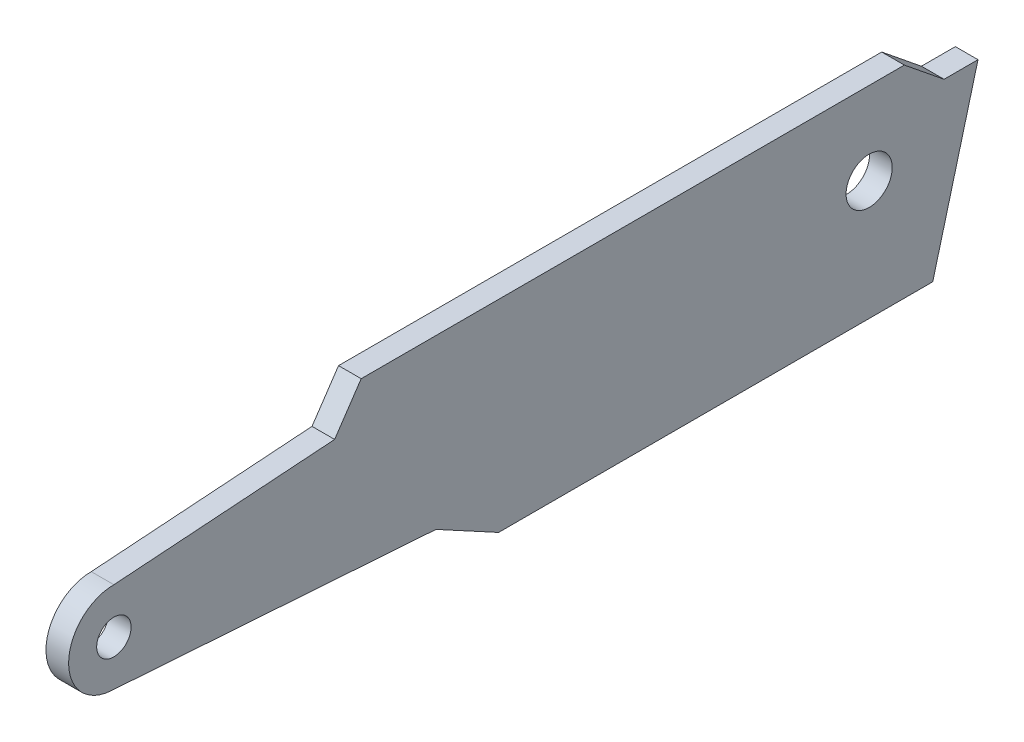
from build123d import *

# Parameters (mm, degrees)
SKETCH1_R           = 2.413
BOSS_EXTRUDE1_DEPTH = 1.5875
SKETCH2_R           = 3.2385
CUT_EXTRUDE1_DEPTH  = 123.101864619


with BuildPart() as part:
    # Sketch1 → Boss-Extrude1 (new, symmetric)
    with BuildSketch(Plane(origin=(0, 0, 0), x_dir=(0, 0, -1), z_dir=(1, 0, 0))):
        with BuildLine():
            Line((30.9687047, 8.51554279), (0, 6.35))
            ThreePointArc((0, 6.35), (-6.346131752, 0.221611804), (-0.442953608, -6.334531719))
            Line((-0.442953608, -6.334531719), (45.182868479, -9.525))
            Line((45.182868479, -9.525), (53.975, -14.2875))
            Line((53.975, -14.2875), (114.8715, -14.2875))
            Line((114.8715, -14.2875), (121.2215, 9.525))
            Line((121.2215, 9.525), (116.459, 9.525))
            Line((116.459, 9.525), (110.890613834, 14.0335))
            Line((110.890613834, 14.0335), (34.690613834, 14.0335))
            Line((34.690613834, 14.0335), (30.9687047, 8.51554279))
        make_face()
        Circle(SKETCH1_R, mode=Mode.SUBTRACT)
    extrude(amount=BOSS_EXTRUDE1_DEPTH, both=True)

    # Sketch2 → Cut-Extrude1 (cut, through all)
    with BuildSketch(Plane(origin=(1.5875, 0, 0), x_dir=(0, 0, -1), z_dir=(1, 0, 0))):
        with Locations((105.951769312, 2.443468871)):
            Circle(SKETCH2_R)
    extrude(amount=-CUT_EXTRUDE1_DEPTH, mode=Mode.SUBTRACT)


solid = part.part
